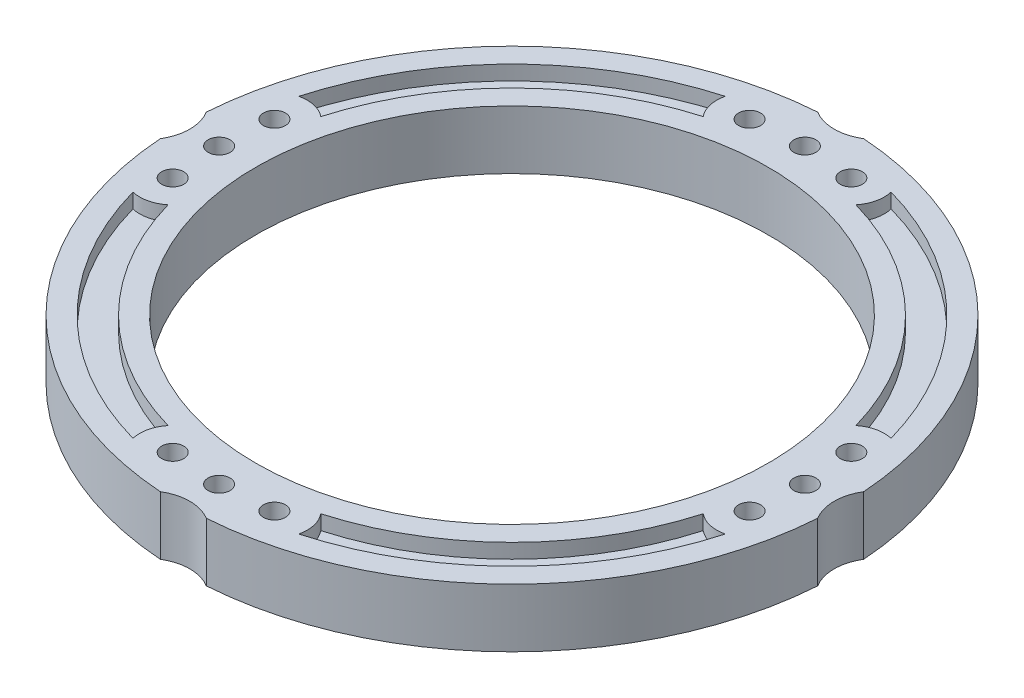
from build123d import *

# Parameters (mm, degrees)
SKETCH1_R           = 45
SKETCH1_R_2         = 1.5
SKETCH1_R_3         = 35
BOSS_EXTRUDE1_DEPTH = 8
CUT_EXTRUDE1_DEPTH  = 2
CUT_EXTRUDE2_START  = -2
CUT_EXTRUDE2_DEPTH  = 2
SKETCH4_R           = 6
CUT_EXTRUDE3_DEPTH  = 10


with BuildPart() as part:
    # Sketch1 → Boss-Extrude1 (new body)
    with BuildSketch(Plane(origin=(0, 0, 0), x_dir=(1, 0, 0), z_dir=(0, 1, 0))):
        with Locations(Location((0, 0, 0), (0, 0, 270))):
            Circle(SKETCH1_R)
        with Locations(Location((0, 40, 0), (0, 0, 270))):
            Circle(SKETCH1_R_2, mode=Mode.SUBTRACT)
        with Locations(Location((40, 0, 0), (0, 0, 270))):
            Circle(SKETCH1_R_2, mode=Mode.SUBTRACT)
        with Locations(Location((0, -40, 0), (0, 0, 270))):
            Circle(SKETCH1_R_2, mode=Mode.SUBTRACT)
        with Locations(Location((-40, 0, 0), (0, 0, 270))):
            Circle(SKETCH1_R_2, mode=Mode.SUBTRACT)
        with Locations(Location((0, 0, 0), (0, 0, 270))):
            Circle(SKETCH1_R_3, mode=Mode.SUBTRACT)
        with Locations(Location((6.945927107, 39.39231012, 0), (0, 0, 270))):
            Circle(SKETCH1_R_2, mode=Mode.SUBTRACT)
        with Locations(Location((-6.945927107, 39.39231012, 0), (0, 0, 270))):
            Circle(SKETCH1_R_2, mode=Mode.SUBTRACT)
        with Locations(Location((39.39231012, 6.945927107, 0), (0, 0, 270))):
            Circle(SKETCH1_R_2, mode=Mode.SUBTRACT)
        with Locations(Location((39.39231012, -6.945927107, 0), (0, 0, 270))):
            Circle(SKETCH1_R_2, mode=Mode.SUBTRACT)
        with Locations(Location((6.945927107, -39.39231012, 0), (0, 0, 270))):
            Circle(SKETCH1_R_2, mode=Mode.SUBTRACT)
        with Locations(Location((-6.945927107, -39.39231012, 0), (0, 0, 270))):
            Circle(SKETCH1_R_2, mode=Mode.SUBTRACT)
        with Locations(Location((-39.39231012, -6.945927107, 0), (0, 0, 270))):
            Circle(SKETCH1_R_2, mode=Mode.SUBTRACT)
        with Locations(Location((-39.39231012, 6.945927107, 0), (0, 0, 270))):
            Circle(SKETCH1_R_2, mode=Mode.SUBTRACT)
    extrude(amount=BOSS_EXTRUDE1_DEPTH)

    # Sketch2 → Cut-Extrude1 (cut)
    with BuildSketch(Plane(origin=(0, 8, 0), x_dir=(1, 0, 0), z_dir=(0, 1, 0))):
        with BuildLine():
            ThreePointArc((10.427551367, 36.541294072), (26.870057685, 26.870057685), (36.541294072, 10.427551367))
            ThreePointArc((36.541294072, 10.427551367), (38.388510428, 11.332541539), (40.445469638, 11.320953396))
            ThreePointArc((40.445469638, 11.320953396), (29.69848481, 29.69848481), (11.320953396, 40.445469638))
            ThreePointArc((11.320953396, 40.445469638), (11.332541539, 38.388510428), (10.427551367, 36.541294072))
        make_face()
        with BuildLine():
            ThreePointArc((40.445469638, -11.320953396), (38.388510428, -11.332541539), (36.541294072, -10.427551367))
            ThreePointArc((36.541294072, -10.427551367), (26.870057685, -26.870057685), (10.427551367, -36.541294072))
            ThreePointArc((10.427551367, -36.541294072), (11.332541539, -38.388510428), (11.320953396, -40.445469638))
            ThreePointArc((11.320953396, -40.445469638), (29.69848481, -29.69848481), (40.445469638, -11.320953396))
        make_face()
        with BuildLine():
            ThreePointArc((-36.541294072, 10.427551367), (-26.870057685, 26.870057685), (-10.427551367, 36.541294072))
            ThreePointArc((-10.427551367, 36.541294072), (-11.332541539, 38.388510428), (-11.320953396, 40.445469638))
            ThreePointArc((-11.320953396, 40.445469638), (-29.69848481, 29.69848481), (-40.445469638, 11.320953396))
            ThreePointArc((-40.445469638, 11.320953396), (-38.388510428, 11.332541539), (-36.541294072, 10.427551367))
        make_face()
        with BuildLine():
            ThreePointArc((-11.320953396, -40.445469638), (-11.332541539, -38.388510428), (-10.427551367, -36.541294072))
            ThreePointArc((-10.427551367, -36.541294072), (-26.870057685, -26.870057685), (-36.541294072, -10.427551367))
            ThreePointArc((-36.541294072, -10.427551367), (-38.388510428, -11.332541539), (-40.445469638, -11.320953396))
            ThreePointArc((-40.445469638, -11.320953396), (-29.69848481, -29.69848481), (-11.320953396, -40.445469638))
        make_face()
    extrude(amount=-CUT_EXTRUDE1_DEPTH, mode=Mode.SUBTRACT)

    # Sketch3 → Cut-Extrude2 (cut)
    with BuildSketch(Plane.XZ.offset(CUT_EXTRUDE2_START)):
        with BuildLine():
            ThreePointArc((10.427551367, 36.541294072), (26.870057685, 26.870057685), (36.541294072, 10.427551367))
            ThreePointArc((36.541294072, 10.427551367), (38.388510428, 11.332541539), (40.445469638, 11.320953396))
            ThreePointArc((40.445469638, 11.320953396), (29.69848481, 29.69848481), (11.320953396, 40.445469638))
            ThreePointArc((11.320953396, 40.445469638), (11.332541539, 38.388510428), (10.427551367, 36.541294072))
        make_face()
        with BuildLine():
            ThreePointArc((40.445469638, -11.320953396), (38.388510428, -11.332541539), (36.541294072, -10.427551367))
            ThreePointArc((36.541294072, -10.427551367), (26.870057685, -26.870057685), (10.427551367, -36.541294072))
            ThreePointArc((10.427551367, -36.541294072), (11.332541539, -38.388510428), (11.320953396, -40.445469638))
            ThreePointArc((11.320953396, -40.445469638), (29.69848481, -29.69848481), (40.445469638, -11.320953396))
        make_face()
        with BuildLine():
            ThreePointArc((-36.541294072, 10.427551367), (-26.870057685, 26.870057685), (-10.427551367, 36.541294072))
            ThreePointArc((-10.427551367, 36.541294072), (-11.332541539, 38.388510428), (-11.320953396, 40.445469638))
            ThreePointArc((-11.320953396, 40.445469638), (-29.69848481, 29.69848481), (-40.445469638, 11.320953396))
            ThreePointArc((-40.445469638, 11.320953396), (-38.388510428, 11.332541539), (-36.541294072, 10.427551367))
        make_face()
        with BuildLine():
            ThreePointArc((-11.320953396, -40.445469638), (-11.332541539, -38.388510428), (-10.427551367, -36.541294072))
            ThreePointArc((-10.427551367, -36.541294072), (-26.870057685, -26.870057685), (-36.541294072, -10.427551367))
            ThreePointArc((-36.541294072, -10.427551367), (-38.388510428, -11.332541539), (-40.445469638, -11.320953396))
            ThreePointArc((-40.445469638, -11.320953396), (-29.69848481, -29.69848481), (-11.320953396, -40.445469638))
        make_face()
    extrude(amount=CUT_EXTRUDE2_DEPTH, mode=Mode.SUBTRACT)

    # Sketch4 → Cut-Extrude3 (cut)
    with BuildSketch(Plane(origin=(0, 0, 0), x_dir=(-1, 0, 0), z_dir=(0, -1, 0))):
        with Locations((0, 50)):
            Circle(SKETCH4_R)
        with Locations((50, 0)):
            Circle(SKETCH4_R)
        with Locations((0, -50)):
            Circle(SKETCH4_R)
        with Locations((-50, 0)):
            Circle(SKETCH4_R)
    extrude(amount=-CUT_EXTRUDE3_DEPTH, mode=Mode.SUBTRACT)


solid = part.part
